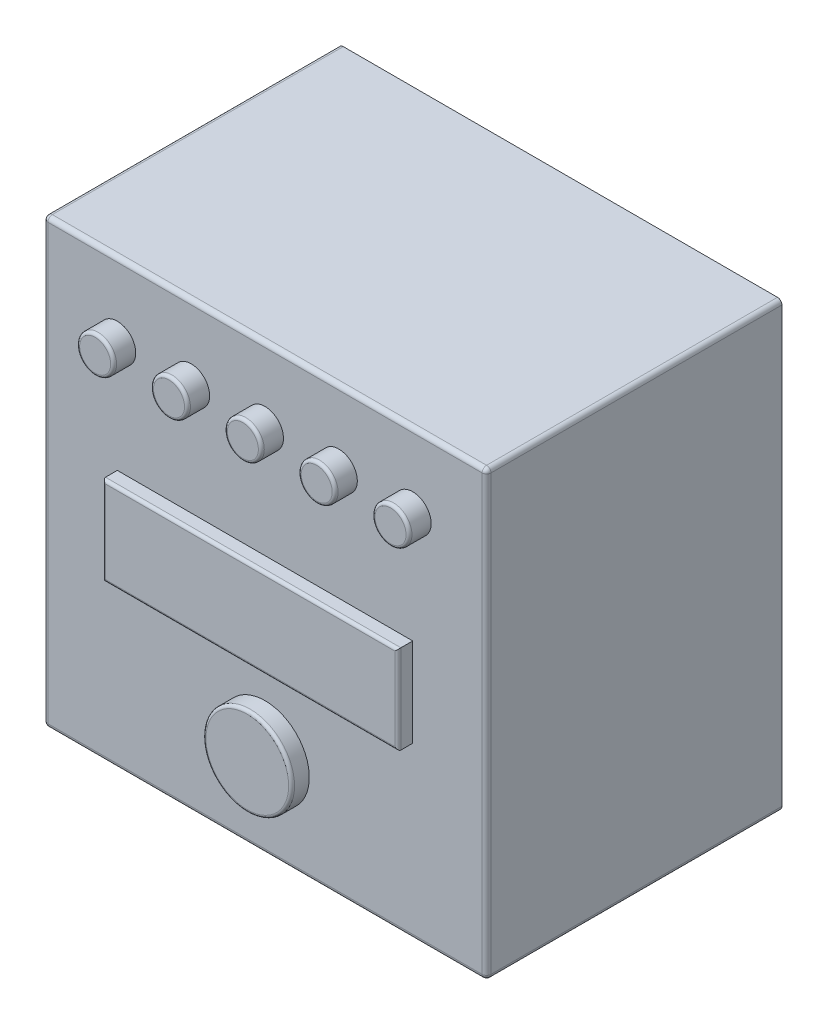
ISO-10303-21;
HEADER;
FILE_DESCRIPTION(('STEP AP214'),'2;1');
FILE_NAME('part.step','',(''),(''),'','','');
FILE_SCHEMA(('AUTOMOTIVE_DESIGN { 1 0 10303 214 1 1 1 1 }'));
ENDSEC;
DATA;
#1=APPLICATION_CONTEXT('core data for automotive mechanical design processes');
#2=APPLICATION_PROTOCOL_DEFINITION('international standard','automotive_design',2000,#1);
#3=PRODUCT_CONTEXT('',#1,'mechanical');
#4=PRODUCT('Part','Part','',(#3));
#5=PRODUCT_RELATED_PRODUCT_CATEGORY('part','',(#4));
#6=PRODUCT_DEFINITION_FORMATION('','',#4);
#7=PRODUCT_DEFINITION_CONTEXT('part definition',#1,'design');
#8=PRODUCT_DEFINITION('design','',#6,#7);
#9=PRODUCT_DEFINITION_SHAPE('','',#8);
#10=(LENGTH_UNIT() NAMED_UNIT(*) SI_UNIT(.MILLI.,.METRE.));
#11=(NAMED_UNIT(*) PLANE_ANGLE_UNIT() SI_UNIT($,.RADIAN.));
#12=(NAMED_UNIT(*) SI_UNIT($,.STERADIAN.) SOLID_ANGLE_UNIT());
#13=UNCERTAINTY_MEASURE_WITH_UNIT(LENGTH_MEASURE(1.E-05),#10,'distance_accuracy_value','');
#14=(GEOMETRIC_REPRESENTATION_CONTEXT(3) GLOBAL_UNCERTAINTY_ASSIGNED_CONTEXT((#13)) GLOBAL_UNIT_ASSIGNED_CONTEXT((#10,
#11,#12)) REPRESENTATION_CONTEXT('',''));
#15=CARTESIAN_POINT('',(0.,0.,0.));
#16=DIRECTION('',(0.,0.,1.));
#17=DIRECTION('',(1.,0.,0.));
#18=AXIS2_PLACEMENT_3D('',#15,#16,#17);
#19=CARTESIAN_POINT('',(0.,300.,200.));
#20=DIRECTION('',(0.,0.,-1.));
#21=DIRECTION('',(-1.,0.,0.));
#22=AXIS2_PLACEMENT_3D('',#19,#20,#21);
#23=PLANE('',#22);
#24=DIRECTION('',(0.,-1.,0.));
#25=VECTOR('',#24,1.);
#26=CARTESIAN_POINT('',(3.,300.,200.));
#27=LINE('',#26,#25);
#28=CARTESIAN_POINT('',(3.,297.,200.));
#29=VERTEX_POINT('',#28);
#30=CARTESIAN_POINT('',(3.,3.,200.));
#31=VERTEX_POINT('',#30);
#32=EDGE_CURVE('E333',#29,#31,#27,.T.);
#33=ORIENTED_EDGE('',*,*,#32,.T.);
#34=DIRECTION('',(1.,0.,0.));
#35=VECTOR('',#34,1.);
#36=CARTESIAN_POINT('',(0.,3.,200.));
#37=LINE('',#36,#35);
#38=CARTESIAN_POINT('',(297.,3.,200.));
#39=VERTEX_POINT('',#38);
#40=EDGE_CURVE('E339',#31,#39,#37,.T.);
#41=ORIENTED_EDGE('',*,*,#40,.T.);
#42=DIRECTION('',(0.,1.,0.));
#43=VECTOR('',#42,1.);
#44=CARTESIAN_POINT('',(297.,300.,200.));
#45=LINE('',#44,#43);
#46=CARTESIAN_POINT('',(297.,297.,200.));
#47=VERTEX_POINT('',#46);
#48=EDGE_CURVE('E337',#39,#47,#45,.T.);
#49=ORIENTED_EDGE('',*,*,#48,.T.);
#50=DIRECTION('',(-1.,0.,0.));
#51=VECTOR('',#50,1.);
#52=CARTESIAN_POINT('',(0.,297.,200.));
#53=LINE('',#52,#51);
#54=EDGE_CURVE('E335',#47,#29,#53,.T.);
#55=ORIENTED_EDGE('',*,*,#54,.T.);
#56=EDGE_LOOP('',(#33,#41,#49,#55));
#57=FACE_BOUND('',#56,.T.);
#58=DIRECTION('',(0.,-1.,0.));
#59=VECTOR('',#58,1.);
#60=CARTESIAN_POINT('',(50.,175.,200.));
#61=LINE('',#60,#59);
#62=CARTESIAN_POINT('',(50.,175.,200.));
#63=VERTEX_POINT('',#62);
#64=CARTESIAN_POINT('',(50.,115.,200.));
#65=VERTEX_POINT('',#64);
#66=EDGE_CURVE('E169',#63,#65,#61,.T.);
#67=ORIENTED_EDGE('',*,*,#66,.F.);
#68=DIRECTION('',(-1.,0.,0.));
#69=VECTOR('',#68,1.);
#70=CARTESIAN_POINT('',(50.,175.,200.));
#71=LINE('',#70,#69);
#72=CARTESIAN_POINT('',(250.,175.,200.));
#73=VERTEX_POINT('',#72);
#74=EDGE_CURVE('E176',#73,#63,#71,.T.);
#75=ORIENTED_EDGE('',*,*,#74,.F.);
#76=DIRECTION('',(0.,1.,0.));
#77=VECTOR('',#76,1.);
#78=CARTESIAN_POINT('',(250.,175.,200.));
#79=LINE('',#78,#77);
#80=CARTESIAN_POINT('',(250.,115.,200.));
#81=VERTEX_POINT('',#80);
#82=EDGE_CURVE('E190',#81,#73,#79,.T.);
#83=ORIENTED_EDGE('',*,*,#82,.F.);
#84=DIRECTION('',(1.,0.,0.));
#85=VECTOR('',#84,1.);
#86=CARTESIAN_POINT('',(50.,115.,200.));
#87=LINE('',#86,#85);
#88=EDGE_CURVE('E185',#65,#81,#87,.T.);
#89=ORIENTED_EDGE('',*,*,#88,.F.);
#90=EDGE_LOOP('',(#67,#75,#83,#89));
#91=FACE_BOUND('',#90,.T.);
#92=CARTESIAN_POINT('',(200.,250.,200.));
#93=DIRECTION('',(0.,0.,-1.));
#94=DIRECTION('',(-1.,0.,0.));
#95=AXIS2_PLACEMENT_3D('',#92,#93,#94);
#96=CIRCLE('',#95,12.5);
#97=CARTESIAN_POINT('',(187.5,250.,200.));
#98=VERTEX_POINT('',#97);
#99=EDGE_CURVE('E250',#98,#98,#96,.F.);
#100=ORIENTED_EDGE('',*,*,#99,.F.);
#101=EDGE_LOOP('',(#100));
#102=FACE_BOUND('',#101,.T.);
#103=CARTESIAN_POINT('',(100.,250.,200.));
#104=DIRECTION('',(0.,0.,-1.));
#105=DIRECTION('',(-1.,0.,0.));
#106=AXIS2_PLACEMENT_3D('',#103,#104,#105);
#107=CIRCLE('',#106,12.5);
#108=CARTESIAN_POINT('',(87.5,250.,200.));
#109=VERTEX_POINT('',#108);
#110=EDGE_CURVE('E244',#109,#109,#107,.F.);
#111=ORIENTED_EDGE('',*,*,#110,.F.);
#112=EDGE_LOOP('',(#111));
#113=FACE_BOUND('',#112,.T.);
#114=CARTESIAN_POINT('',(50.,250.,200.));
#115=DIRECTION('',(0.,0.,-1.));
#116=DIRECTION('',(-1.,0.,0.));
#117=AXIS2_PLACEMENT_3D('',#114,#115,#116);
#118=CIRCLE('',#117,12.5);
#119=CARTESIAN_POINT('',(37.5,250.,200.));
#120=VERTEX_POINT('',#119);
#121=EDGE_CURVE('E214',#120,#120,#118,.F.);
#122=ORIENTED_EDGE('',*,*,#121,.F.);
#123=EDGE_LOOP('',(#122));
#124=FACE_BOUND('',#123,.T.);
#125=CARTESIAN_POINT('',(150.,250.,200.));
#126=DIRECTION('',(0.,0.,-1.));
#127=DIRECTION('',(-1.,0.,0.));
#128=AXIS2_PLACEMENT_3D('',#125,#126,#127);
#129=CIRCLE('',#128,12.5);
#130=CARTESIAN_POINT('',(137.5,250.,200.));
#131=VERTEX_POINT('',#130);
#132=EDGE_CURVE('E247',#131,#131,#129,.F.);
#133=ORIENTED_EDGE('',*,*,#132,.F.);
#134=EDGE_LOOP('',(#133));
#135=FACE_BOUND('',#134,.T.);
#136=CARTESIAN_POINT('',(250.,250.,200.));
#137=DIRECTION('',(0.,0.,-1.));
#138=DIRECTION('',(-1.,0.,0.));
#139=AXIS2_PLACEMENT_3D('',#136,#137,#138);
#140=CIRCLE('',#139,12.5);
#141=CARTESIAN_POINT('',(237.5,250.,200.));
#142=VERTEX_POINT('',#141);
#143=EDGE_CURVE('E253',#142,#142,#140,.F.);
#144=ORIENTED_EDGE('',*,*,#143,.F.);
#145=EDGE_LOOP('',(#144));
#146=FACE_BOUND('',#145,.T.);
#147=CARTESIAN_POINT('',(150.,60.,200.));
#148=DIRECTION('',(0.,0.,-1.));
#149=DIRECTION('',(-1.,0.,0.));
#150=AXIS2_PLACEMENT_3D('',#147,#148,#149);
#151=CIRCLE('',#150,30.);
#152=CARTESIAN_POINT('',(120.,60.,200.));
#153=VERTEX_POINT('',#152);
#154=EDGE_CURVE('E303',#153,#153,#151,.F.);
#155=ORIENTED_EDGE('',*,*,#154,.F.);
#156=EDGE_LOOP('',(#155));
#157=FACE_BOUND('',#156,.T.);
#158=ADVANCED_FACE('F28',(#57,#91,#102,#113,#124,#135,#146,#157),#23,.F.);
#159=CARTESIAN_POINT('',(0.,0.,200.));
#160=DIRECTION('',(1.,0.,0.));
#161=DIRECTION('',(0.,0.,-1.));
#162=AXIS2_PLACEMENT_3D('',#159,#160,#161);
#163=PLANE('',#162);
#164=DIRECTION('',(0.,-1.,0.));
#165=VECTOR('',#164,1.);
#166=CARTESIAN_POINT('',(0.,0.,0.));
#167=LINE('',#166,#165);
#168=CARTESIAN_POINT('',(0.,297.,0.));
#169=VERTEX_POINT('',#168);
#170=CARTESIAN_POINT('',(0.,3.,0.));
#171=VERTEX_POINT('',#170);
#172=EDGE_CURVE('E200',#169,#171,#167,.T.);
#173=ORIENTED_EDGE('',*,*,#172,.T.);
#174=DIRECTION('',(0.,0.,-1.));
#175=VECTOR('',#174,1.);
#176=CARTESIAN_POINT('',(0.,3.,200.));
#177=LINE('',#176,#175);
#178=CARTESIAN_POINT('',(0.,3.,197.));
#179=VERTEX_POINT('',#178);
#180=EDGE_CURVE('E325',#171,#179,#177,.F.);
#181=ORIENTED_EDGE('',*,*,#180,.T.);
#182=DIRECTION('',(0.,-1.,0.));
#183=VECTOR('',#182,1.);
#184=CARTESIAN_POINT('',(0.,0.,197.));
#185=LINE('',#184,#183);
#186=CARTESIAN_POINT('',(0.,297.,197.));
#187=VERTEX_POINT('',#186);
#188=EDGE_CURVE('E321',#179,#187,#185,.F.);
#189=ORIENTED_EDGE('',*,*,#188,.T.);
#190=DIRECTION('',(0.,0.,-1.));
#191=VECTOR('',#190,1.);
#192=CARTESIAN_POINT('',(0.,297.,200.));
#193=LINE('',#192,#191);
#194=EDGE_CURVE('E323',#187,#169,#193,.T.);
#195=ORIENTED_EDGE('',*,*,#194,.T.);
#196=EDGE_LOOP('',(#173,#181,#189,#195));
#197=FACE_BOUND('',#196,.T.);
#198=ADVANCED_FACE('F364',(#197),#163,.F.);
#199=CARTESIAN_POINT('',(0.,0.,200.));
#200=DIRECTION('',(0.,1.,0.));
#201=DIRECTION('',(0.,0.,1.));
#202=AXIS2_PLACEMENT_3D('',#199,#200,#201);
#203=PLANE('',#202);
#204=DIRECTION('',(1.,0.,0.));
#205=VECTOR('',#204,1.);
#206=CARTESIAN_POINT('',(0.,0.,197.));
#207=LINE('',#206,#205);
#208=CARTESIAN_POINT('',(297.,0.,197.));
#209=VERTEX_POINT('',#208);
#210=CARTESIAN_POINT('',(3.,0.,197.));
#211=VERTEX_POINT('',#210);
#212=EDGE_CURVE('E306',#209,#211,#207,.F.);
#213=ORIENTED_EDGE('',*,*,#212,.T.);
#214=DIRECTION('',(0.,0.,-1.));
#215=VECTOR('',#214,1.);
#216=CARTESIAN_POINT('',(3.,0.,200.));
#217=LINE('',#216,#215);
#218=CARTESIAN_POINT('',(3.,0.,0.));
#219=VERTEX_POINT('',#218);
#220=EDGE_CURVE('E310',#211,#219,#217,.T.);
#221=ORIENTED_EDGE('',*,*,#220,.T.);
#222=DIRECTION('',(1.,0.,0.));
#223=VECTOR('',#222,1.);
#224=CARTESIAN_POINT('',(0.,0.,0.));
#225=LINE('',#224,#223);
#226=CARTESIAN_POINT('',(297.,0.,0.));
#227=VERTEX_POINT('',#226);
#228=EDGE_CURVE('E203',#219,#227,#225,.T.);
#229=ORIENTED_EDGE('',*,*,#228,.T.);
#230=DIRECTION('',(0.,0.,-1.));
#231=VECTOR('',#230,1.);
#232=CARTESIAN_POINT('',(297.,0.,200.));
#233=LINE('',#232,#231);
#234=EDGE_CURVE('E308',#227,#209,#233,.F.);
#235=ORIENTED_EDGE('',*,*,#234,.T.);
#236=EDGE_LOOP('',(#213,#221,#229,#235));
#237=FACE_BOUND('',#236,.T.);
#238=ADVANCED_FACE('F371',(#237),#203,.F.);
#239=CARTESIAN_POINT('',(300.,0.,200.));
#240=DIRECTION('',(-1.,0.,0.));
#241=DIRECTION('',(0.,0.,1.));
#242=AXIS2_PLACEMENT_3D('',#239,#240,#241);
#243=PLANE('',#242);
#244=DIRECTION('',(0.,1.,0.));
#245=VECTOR('',#244,1.);
#246=CARTESIAN_POINT('',(300.,0.,197.));
#247=LINE('',#246,#245);
#248=CARTESIAN_POINT('',(300.,297.,197.));
#249=VERTEX_POINT('',#248);
#250=CARTESIAN_POINT('',(300.,3.,197.));
#251=VERTEX_POINT('',#250);
#252=EDGE_CURVE('E329',#249,#251,#247,.F.);
#253=ORIENTED_EDGE('',*,*,#252,.T.);
#254=DIRECTION('',(0.,0.,-1.));
#255=VECTOR('',#254,1.);
#256=CARTESIAN_POINT('',(300.,3.,200.));
#257=LINE('',#256,#255);
#258=CARTESIAN_POINT('',(300.,3.,0.));
#259=VERTEX_POINT('',#258);
#260=EDGE_CURVE('E331',#251,#259,#257,.T.);
#261=ORIENTED_EDGE('',*,*,#260,.T.);
#262=DIRECTION('',(0.,1.,0.));
#263=VECTOR('',#262,1.);
#264=CARTESIAN_POINT('',(300.,0.,0.));
#265=LINE('',#264,#263);
#266=CARTESIAN_POINT('',(300.,297.,0.));
#267=VERTEX_POINT('',#266);
#268=EDGE_CURVE('E206',#259,#267,#265,.T.);
#269=ORIENTED_EDGE('',*,*,#268,.T.);
#270=DIRECTION('',(0.,0.,-1.));
#271=VECTOR('',#270,1.);
#272=CARTESIAN_POINT('',(300.,297.,200.));
#273=LINE('',#272,#271);
#274=EDGE_CURVE('E327',#267,#249,#273,.F.);
#275=ORIENTED_EDGE('',*,*,#274,.T.);
#276=EDGE_LOOP('',(#253,#261,#269,#275));
#277=FACE_BOUND('',#276,.T.);
#278=ADVANCED_FACE('F381',(#277),#243,.F.);
#279=CARTESIAN_POINT('',(0.,300.,200.));
#280=DIRECTION('',(0.,-1.,0.));
#281=DIRECTION('',(0.,0.,-1.));
#282=AXIS2_PLACEMENT_3D('',#279,#280,#281);
#283=PLANE('',#282);
#284=DIRECTION('',(-1.,0.,0.));
#285=VECTOR('',#284,1.);
#286=CARTESIAN_POINT('',(0.,300.,197.));
#287=LINE('',#286,#285);
#288=CARTESIAN_POINT('',(3.,300.,197.));
#289=VERTEX_POINT('',#288);
#290=CARTESIAN_POINT('',(297.,300.,197.));
#291=VERTEX_POINT('',#290);
#292=EDGE_CURVE('E44',#289,#291,#287,.F.);
#293=ORIENTED_EDGE('',*,*,#292,.T.);
#294=DIRECTION('',(0.,0.,-1.));
#295=VECTOR('',#294,1.);
#296=CARTESIAN_POINT('',(297.,300.,200.));
#297=LINE('',#296,#295);
#298=CARTESIAN_POINT('',(297.,300.,0.));
#299=VERTEX_POINT('',#298);
#300=EDGE_CURVE('E344',#291,#299,#297,.T.);
#301=ORIENTED_EDGE('',*,*,#300,.T.);
#302=DIRECTION('',(-1.,0.,0.));
#303=VECTOR('',#302,1.);
#304=CARTESIAN_POINT('',(0.,300.,0.));
#305=LINE('',#304,#303);
#306=CARTESIAN_POINT('',(3.,300.,0.));
#307=VERTEX_POINT('',#306);
#308=EDGE_CURVE('E209',#299,#307,#305,.T.);
#309=ORIENTED_EDGE('',*,*,#308,.T.);
#310=DIRECTION('',(0.,0.,-1.));
#311=VECTOR('',#310,1.);
#312=CARTESIAN_POINT('',(3.,300.,200.));
#313=LINE('',#312,#311);
#314=EDGE_CURVE('E49',#307,#289,#313,.F.);
#315=ORIENTED_EDGE('',*,*,#314,.T.);
#316=EDGE_LOOP('',(#293,#301,#309,#315));
#317=FACE_BOUND('',#316,.T.);
#318=ADVANCED_FACE('F378',(#317),#283,.F.);
#319=CARTESIAN_POINT('',(0.,300.,0.));
#320=DIRECTION('',(0.,0.,-1.));
#321=DIRECTION('',(-1.,0.,0.));
#322=AXIS2_PLACEMENT_3D('',#319,#320,#321);
#323=PLANE('',#322);
#324=ORIENTED_EDGE('',*,*,#228,.F.);
#325=CARTESIAN_POINT('',(3.,3.,0.));
#326=DIRECTION('',(0.,0.,-1.));
#327=DIRECTION('',(-1.,0.,0.));
#328=AXIS2_PLACEMENT_3D('',#325,#326,#327);
#329=CIRCLE('',#328,3.);
#330=EDGE_CURVE('E319',#219,#171,#329,.T.);
#331=ORIENTED_EDGE('',*,*,#330,.T.);
#332=ORIENTED_EDGE('',*,*,#172,.F.);
#333=CARTESIAN_POINT('',(3.,297.,0.));
#334=DIRECTION('',(0.,0.,-1.));
#335=DIRECTION('',(-1.,0.,0.));
#336=AXIS2_PLACEMENT_3D('',#333,#334,#335);
#337=CIRCLE('',#336,3.);
#338=EDGE_CURVE('E313',#169,#307,#337,.T.);
#339=ORIENTED_EDGE('',*,*,#338,.T.);
#340=ORIENTED_EDGE('',*,*,#308,.F.);
#341=CARTESIAN_POINT('',(297.,297.,0.));
#342=DIRECTION('',(0.,0.,-1.));
#343=DIRECTION('',(-1.,0.,0.));
#344=AXIS2_PLACEMENT_3D('',#341,#342,#343);
#345=CIRCLE('',#344,3.);
#346=EDGE_CURVE('E315',#299,#267,#345,.T.);
#347=ORIENTED_EDGE('',*,*,#346,.T.);
#348=ORIENTED_EDGE('',*,*,#268,.F.);
#349=CARTESIAN_POINT('',(297.,3.,0.));
#350=DIRECTION('',(0.,0.,-1.));
#351=DIRECTION('',(-1.,0.,0.));
#352=AXIS2_PLACEMENT_3D('',#349,#350,#351);
#353=CIRCLE('',#352,3.);
#354=EDGE_CURVE('E317',#259,#227,#353,.T.);
#355=ORIENTED_EDGE('',*,*,#354,.T.);
#356=EDGE_LOOP('',(#324,#331,#332,#339,#340,#347,#348,#355));
#357=FACE_BOUND('',#356,.T.);
#358=ADVANCED_FACE('F376',(#357),#323,.T.);
#359=CARTESIAN_POINT('',(50.,250.,215.));
#360=DIRECTION('',(0.,0.,-1.));
#361=DIRECTION('',(-1.,0.,0.));
#362=AXIS2_PLACEMENT_3D('',#359,#360,#361);
#363=CYLINDRICAL_SURFACE('',#362,12.5);
#364=CARTESIAN_POINT('',(50.,250.,213.));
#365=DIRECTION('',(0.,0.,1.));
#366=DIRECTION('',(1.,0.,0.));
#367=AXIS2_PLACEMENT_3D('',#364,#365,#366);
#368=CIRCLE('',#367,12.5);
#369=CARTESIAN_POINT('',(62.5,250.,213.));
#370=VERTEX_POINT('',#369);
#371=EDGE_CURVE('E283',#370,#370,#368,.F.);
#372=ORIENTED_EDGE('',*,*,#371,.T.);
#373=EDGE_LOOP('',(#372));
#374=FACE_BOUND('',#373,.T.);
#375=ORIENTED_EDGE('',*,*,#121,.T.);
#376=EDGE_LOOP('',(#375));
#377=FACE_BOUND('',#376,.T.);
#378=ADVANCED_FACE('F427',(#374,#377),#363,.T.);
#379=CARTESIAN_POINT('',(50.,250.,215.));
#380=DIRECTION('',(0.,0.,1.));
#381=DIRECTION('',(1.,0.,0.));
#382=AXIS2_PLACEMENT_3D('',#379,#380,#381);
#383=PLANE('',#382);
#384=CARTESIAN_POINT('',(50.,250.,215.));
#385=DIRECTION('',(0.,0.,1.));
#386=DIRECTION('',(1.,0.,0.));
#387=AXIS2_PLACEMENT_3D('',#384,#385,#386);
#388=CIRCLE('',#387,10.5);
#389=CARTESIAN_POINT('',(60.5,250.,215.));
#390=VERTEX_POINT('',#389);
#391=EDGE_CURVE('E280',#390,#390,#388,.T.);
#392=ORIENTED_EDGE('',*,*,#391,.T.);
#393=EDGE_LOOP('',(#392));
#394=FACE_BOUND('',#393,.T.);
#395=ADVANCED_FACE('F430',(#394),#383,.T.);
#396=CARTESIAN_POINT('',(100.,250.,215.));
#397=DIRECTION('',(0.,0.,-1.));
#398=DIRECTION('',(-1.,0.,0.));
#399=AXIS2_PLACEMENT_3D('',#396,#397,#398);
#400=CYLINDRICAL_SURFACE('',#399,12.5);
#401=CARTESIAN_POINT('',(100.,250.,213.));
#402=DIRECTION('',(0.,0.,1.));
#403=DIRECTION('',(1.,0.,0.));
#404=AXIS2_PLACEMENT_3D('',#401,#402,#403);
#405=CIRCLE('',#404,12.5);
#406=CARTESIAN_POINT('',(112.5,250.,213.));
#407=VERTEX_POINT('',#406);
#408=EDGE_CURVE('E265',#407,#407,#405,.F.);
#409=ORIENTED_EDGE('',*,*,#408,.T.);
#410=EDGE_LOOP('',(#409));
#411=FACE_BOUND('',#410,.T.);
#412=ORIENTED_EDGE('',*,*,#110,.T.);
#413=EDGE_LOOP('',(#412));
#414=FACE_BOUND('',#413,.T.);
#415=ADVANCED_FACE('F437',(#411,#414),#400,.T.);
#416=CARTESIAN_POINT('',(100.,250.,215.));
#417=DIRECTION('',(0.,0.,1.));
#418=DIRECTION('',(1.,0.,0.));
#419=AXIS2_PLACEMENT_3D('',#416,#417,#418);
#420=PLANE('',#419);
#421=CARTESIAN_POINT('',(100.,250.,215.));
#422=DIRECTION('',(0.,0.,1.));
#423=DIRECTION('',(1.,0.,0.));
#424=AXIS2_PLACEMENT_3D('',#421,#422,#423);
#425=CIRCLE('',#424,10.5);
#426=CARTESIAN_POINT('',(110.5,250.,215.));
#427=VERTEX_POINT('',#426);
#428=EDGE_CURVE('E262',#427,#427,#425,.T.);
#429=ORIENTED_EDGE('',*,*,#428,.T.);
#430=EDGE_LOOP('',(#429));
#431=FACE_BOUND('',#430,.T.);
#432=ADVANCED_FACE('F445',(#431),#420,.T.);
#433=CARTESIAN_POINT('',(150.,250.,215.));
#434=DIRECTION('',(0.,0.,-1.));
#435=DIRECTION('',(-1.,0.,0.));
#436=AXIS2_PLACEMENT_3D('',#433,#434,#435);
#437=CYLINDRICAL_SURFACE('',#436,12.5);
#438=CARTESIAN_POINT('',(150.,250.,213.));
#439=DIRECTION('',(0.,0.,1.));
#440=DIRECTION('',(1.,0.,0.));
#441=AXIS2_PLACEMENT_3D('',#438,#439,#440);
#442=CIRCLE('',#441,12.5);
#443=CARTESIAN_POINT('',(162.5,250.,213.));
#444=VERTEX_POINT('',#443);
#445=EDGE_CURVE('E277',#444,#444,#442,.F.);
#446=ORIENTED_EDGE('',*,*,#445,.T.);
#447=EDGE_LOOP('',(#446));
#448=FACE_BOUND('',#447,.T.);
#449=ORIENTED_EDGE('',*,*,#132,.T.);
#450=EDGE_LOOP('',(#449));
#451=FACE_BOUND('',#450,.T.);
#452=ADVANCED_FACE('F453',(#448,#451),#437,.T.);
#453=CARTESIAN_POINT('',(150.,250.,215.));
#454=DIRECTION('',(0.,0.,1.));
#455=DIRECTION('',(1.,0.,0.));
#456=AXIS2_PLACEMENT_3D('',#453,#454,#455);
#457=PLANE('',#456);
#458=CARTESIAN_POINT('',(150.,250.,215.));
#459=DIRECTION('',(0.,0.,1.));
#460=DIRECTION('',(1.,0.,0.));
#461=AXIS2_PLACEMENT_3D('',#458,#459,#460);
#462=CIRCLE('',#461,10.5);
#463=CARTESIAN_POINT('',(160.5,250.,215.));
#464=VERTEX_POINT('',#463);
#465=EDGE_CURVE('E274',#464,#464,#462,.T.);
#466=ORIENTED_EDGE('',*,*,#465,.T.);
#467=EDGE_LOOP('',(#466));
#468=FACE_BOUND('',#467,.T.);
#469=ADVANCED_FACE('F461',(#468),#457,.T.);
#470=CARTESIAN_POINT('',(200.,250.,215.));
#471=DIRECTION('',(0.,0.,-1.));
#472=DIRECTION('',(-1.,0.,0.));
#473=AXIS2_PLACEMENT_3D('',#470,#471,#472);
#474=CYLINDRICAL_SURFACE('',#473,12.5);
#475=CARTESIAN_POINT('',(200.,250.,213.));
#476=DIRECTION('',(0.,0.,1.));
#477=DIRECTION('',(1.,0.,0.));
#478=AXIS2_PLACEMENT_3D('',#475,#476,#477);
#479=CIRCLE('',#478,12.5);
#480=CARTESIAN_POINT('',(212.5,250.,213.));
#481=VERTEX_POINT('',#480);
#482=EDGE_CURVE('E259',#481,#481,#479,.F.);
#483=ORIENTED_EDGE('',*,*,#482,.T.);
#484=EDGE_LOOP('',(#483));
#485=FACE_BOUND('',#484,.T.);
#486=ORIENTED_EDGE('',*,*,#99,.T.);
#487=EDGE_LOOP('',(#486));
#488=FACE_BOUND('',#487,.T.);
#489=ADVANCED_FACE('F469',(#485,#488),#474,.T.);
#490=CARTESIAN_POINT('',(200.,250.,215.));
#491=DIRECTION('',(0.,0.,1.));
#492=DIRECTION('',(1.,0.,0.));
#493=AXIS2_PLACEMENT_3D('',#490,#491,#492);
#494=PLANE('',#493);
#495=CARTESIAN_POINT('',(200.,250.,215.));
#496=DIRECTION('',(0.,0.,1.));
#497=DIRECTION('',(1.,0.,0.));
#498=AXIS2_PLACEMENT_3D('',#495,#496,#497);
#499=CIRCLE('',#498,10.5);
#500=CARTESIAN_POINT('',(210.5,250.,215.));
#501=VERTEX_POINT('',#500);
#502=EDGE_CURVE('E256',#501,#501,#499,.T.);
#503=ORIENTED_EDGE('',*,*,#502,.T.);
#504=EDGE_LOOP('',(#503));
#505=FACE_BOUND('',#504,.T.);
#506=ADVANCED_FACE('F477',(#505),#494,.T.);
#507=CARTESIAN_POINT('',(250.,250.,215.));
#508=DIRECTION('',(0.,0.,-1.));
#509=DIRECTION('',(-1.,0.,0.));
#510=AXIS2_PLACEMENT_3D('',#507,#508,#509);
#511=CYLINDRICAL_SURFACE('',#510,12.5);
#512=CARTESIAN_POINT('',(250.,250.,213.));
#513=DIRECTION('',(0.,0.,1.));
#514=DIRECTION('',(1.,0.,0.));
#515=AXIS2_PLACEMENT_3D('',#512,#513,#514);
#516=CIRCLE('',#515,12.5);
#517=CARTESIAN_POINT('',(262.5,250.,213.));
#518=VERTEX_POINT('',#517);
#519=EDGE_CURVE('E271',#518,#518,#516,.F.);
#520=ORIENTED_EDGE('',*,*,#519,.T.);
#521=EDGE_LOOP('',(#520));
#522=FACE_BOUND('',#521,.T.);
#523=ORIENTED_EDGE('',*,*,#143,.T.);
#524=EDGE_LOOP('',(#523));
#525=FACE_BOUND('',#524,.T.);
#526=ADVANCED_FACE('F485',(#522,#525),#511,.T.);
#527=CARTESIAN_POINT('',(250.,250.,215.));
#528=DIRECTION('',(0.,0.,1.));
#529=DIRECTION('',(1.,0.,0.));
#530=AXIS2_PLACEMENT_3D('',#527,#528,#529);
#531=PLANE('',#530);
#532=CARTESIAN_POINT('',(250.,250.,215.));
#533=DIRECTION('',(0.,0.,1.));
#534=DIRECTION('',(1.,0.,0.));
#535=AXIS2_PLACEMENT_3D('',#532,#533,#534);
#536=CIRCLE('',#535,10.5);
#537=CARTESIAN_POINT('',(260.5,250.,215.));
#538=VERTEX_POINT('',#537);
#539=EDGE_CURVE('E268',#538,#538,#536,.T.);
#540=ORIENTED_EDGE('',*,*,#539,.T.);
#541=EDGE_LOOP('',(#540));
#542=FACE_BOUND('',#541,.T.);
#543=ADVANCED_FACE('F493',(#542),#531,.T.);
#544=CARTESIAN_POINT('',(200.,250.,213.));
#545=DIRECTION('',(0.,0.,1.));
#546=DIRECTION('',(1.,0.,0.));
#547=AXIS2_PLACEMENT_3D('',#544,#545,#546);
#548=TOROIDAL_SURFACE('',#547,10.5,2.);
#549=ORIENTED_EDGE('',*,*,#482,.F.);
#550=EDGE_LOOP('',(#549));
#551=FACE_BOUND('',#550,.T.);
#552=ORIENTED_EDGE('',*,*,#502,.F.);
#553=EDGE_LOOP('',(#552));
#554=FACE_BOUND('',#553,.T.);
#555=ADVANCED_FACE('F501',(#551,#554),#548,.T.);
#556=CARTESIAN_POINT('',(100.,250.,213.));
#557=DIRECTION('',(0.,0.,1.));
#558=DIRECTION('',(1.,0.,0.));
#559=AXIS2_PLACEMENT_3D('',#556,#557,#558);
#560=TOROIDAL_SURFACE('',#559,10.5,2.);
#561=ORIENTED_EDGE('',*,*,#408,.F.);
#562=EDGE_LOOP('',(#561));
#563=FACE_BOUND('',#562,.T.);
#564=ORIENTED_EDGE('',*,*,#428,.F.);
#565=EDGE_LOOP('',(#564));
#566=FACE_BOUND('',#565,.T.);
#567=ADVANCED_FACE('F509',(#563,#566),#560,.T.);
#568=CARTESIAN_POINT('',(250.,250.,213.));
#569=DIRECTION('',(0.,0.,1.));
#570=DIRECTION('',(1.,0.,0.));
#571=AXIS2_PLACEMENT_3D('',#568,#569,#570);
#572=TOROIDAL_SURFACE('',#571,10.5,2.);
#573=ORIENTED_EDGE('',*,*,#519,.F.);
#574=EDGE_LOOP('',(#573));
#575=FACE_BOUND('',#574,.T.);
#576=ORIENTED_EDGE('',*,*,#539,.F.);
#577=EDGE_LOOP('',(#576));
#578=FACE_BOUND('',#577,.T.);
#579=ADVANCED_FACE('F517',(#575,#578),#572,.T.);
#580=CARTESIAN_POINT('',(150.,250.,213.));
#581=DIRECTION('',(0.,0.,1.));
#582=DIRECTION('',(1.,0.,0.));
#583=AXIS2_PLACEMENT_3D('',#580,#581,#582);
#584=TOROIDAL_SURFACE('',#583,10.5,2.);
#585=ORIENTED_EDGE('',*,*,#445,.F.);
#586=EDGE_LOOP('',(#585));
#587=FACE_BOUND('',#586,.T.);
#588=ORIENTED_EDGE('',*,*,#465,.F.);
#589=EDGE_LOOP('',(#588));
#590=FACE_BOUND('',#589,.T.);
#591=ADVANCED_FACE('F525',(#587,#590),#584,.T.);
#592=CARTESIAN_POINT('',(50.,250.,213.));
#593=DIRECTION('',(0.,0.,1.));
#594=DIRECTION('',(1.,0.,0.));
#595=AXIS2_PLACEMENT_3D('',#592,#593,#594);
#596=TOROIDAL_SURFACE('',#595,10.5,2.);
#597=ORIENTED_EDGE('',*,*,#371,.F.);
#598=EDGE_LOOP('',(#597));
#599=FACE_BOUND('',#598,.T.);
#600=ORIENTED_EDGE('',*,*,#391,.F.);
#601=EDGE_LOOP('',(#600));
#602=FACE_BOUND('',#601,.T.);
#603=ADVANCED_FACE('F533',(#599,#602),#596,.T.);
#604=CARTESIAN_POINT('',(50.,175.,210.));
#605=DIRECTION('',(1.,0.,0.));
#606=DIRECTION('',(0.,1.,0.));
#607=AXIS2_PLACEMENT_3D('',#604,#605,#606);
#608=PLANE('',#607);
#609=DIRECTION('',(0.,0.,-1.));
#610=VECTOR('',#609,1.);
#611=CARTESIAN_POINT('',(50.,115.,210.));
#612=LINE('',#611,#610);
#613=CARTESIAN_POINT('',(50.,115.,208.));
#614=VERTEX_POINT('',#613);
#615=EDGE_CURVE('E198',#614,#65,#612,.T.);
#616=ORIENTED_EDGE('',*,*,#615,.F.);
#617=DIRECTION('',(0.,-1.,0.));
#618=VECTOR('',#617,1.);
#619=CARTESIAN_POINT('',(50.,175.,208.));
#620=LINE('',#619,#618);
#621=CARTESIAN_POINT('',(50.,175.,208.));
#622=VERTEX_POINT('',#621);
#623=EDGE_CURVE('E171',#614,#622,#620,.F.);
#624=ORIENTED_EDGE('',*,*,#623,.T.);
#625=DIRECTION('',(0.,0.,-1.));
#626=VECTOR('',#625,1.);
#627=CARTESIAN_POINT('',(50.,175.,210.));
#628=LINE('',#627,#626);
#629=EDGE_CURVE('E165',#622,#63,#628,.T.);
#630=ORIENTED_EDGE('',*,*,#629,.T.);
#631=ORIENTED_EDGE('',*,*,#66,.T.);
#632=EDGE_LOOP('',(#616,#624,#630,#631));
#633=FACE_BOUND('',#632,.T.);
#634=ADVANCED_FACE('F168',(#633),#608,.F.);
#635=CARTESIAN_POINT('',(50.,115.,210.));
#636=DIRECTION('',(0.,1.,0.));
#637=DIRECTION('',(0.,0.,1.));
#638=AXIS2_PLACEMENT_3D('',#635,#636,#637);
#639=PLANE('',#638);
#640=DIRECTION('',(0.,0.,-1.));
#641=VECTOR('',#640,1.);
#642=CARTESIAN_POINT('',(250.,115.,210.));
#643=LINE('',#642,#641);
#644=CARTESIAN_POINT('',(250.,115.,208.));
#645=VERTEX_POINT('',#644);
#646=EDGE_CURVE('E196',#645,#81,#643,.T.);
#647=ORIENTED_EDGE('',*,*,#646,.F.);
#648=DIRECTION('',(1.,0.,0.));
#649=VECTOR('',#648,1.);
#650=CARTESIAN_POINT('',(50.,115.,208.));
#651=LINE('',#650,#649);
#652=EDGE_CURVE('E298',#645,#614,#651,.F.);
#653=ORIENTED_EDGE('',*,*,#652,.T.);
#654=ORIENTED_EDGE('',*,*,#615,.T.);
#655=ORIENTED_EDGE('',*,*,#88,.T.);
#656=EDGE_LOOP('',(#647,#653,#654,#655));
#657=FACE_BOUND('',#656,.T.);
#658=ADVANCED_FACE('F548',(#657),#639,.F.);
#659=CARTESIAN_POINT('',(250.,175.,210.));
#660=DIRECTION('',(-1.,0.,0.));
#661=DIRECTION('',(0.,0.,1.));
#662=AXIS2_PLACEMENT_3D('',#659,#660,#661);
#663=PLANE('',#662);
#664=DIRECTION('',(0.,0.,-1.));
#665=VECTOR('',#664,1.);
#666=CARTESIAN_POINT('',(250.,175.,210.));
#667=LINE('',#666,#665);
#668=CARTESIAN_POINT('',(250.,175.,208.));
#669=VERTEX_POINT('',#668);
#670=EDGE_CURVE('E175',#669,#73,#667,.T.);
#671=ORIENTED_EDGE('',*,*,#670,.F.);
#672=DIRECTION('',(0.,1.,0.));
#673=VECTOR('',#672,1.);
#674=CARTESIAN_POINT('',(250.,115.,208.));
#675=LINE('',#674,#673);
#676=EDGE_CURVE('E295',#669,#645,#675,.F.);
#677=ORIENTED_EDGE('',*,*,#676,.T.);
#678=ORIENTED_EDGE('',*,*,#646,.T.);
#679=ORIENTED_EDGE('',*,*,#82,.T.);
#680=EDGE_LOOP('',(#671,#677,#678,#679));
#681=FACE_BOUND('',#680,.T.);
#682=ADVANCED_FACE('F555',(#681),#663,.F.);
#683=CARTESIAN_POINT('',(50.,175.,210.));
#684=DIRECTION('',(0.,-1.,0.));
#685=DIRECTION('',(0.,0.,-1.));
#686=AXIS2_PLACEMENT_3D('',#683,#684,#685);
#687=PLANE('',#686);
#688=ORIENTED_EDGE('',*,*,#629,.F.);
#689=DIRECTION('',(-1.,0.,0.));
#690=VECTOR('',#689,1.);
#691=CARTESIAN_POINT('',(250.,175.,208.));
#692=LINE('',#691,#690);
#693=EDGE_CURVE('E300',#622,#669,#692,.F.);
#694=ORIENTED_EDGE('',*,*,#693,.T.);
#695=ORIENTED_EDGE('',*,*,#670,.T.);
#696=ORIENTED_EDGE('',*,*,#74,.T.);
#697=EDGE_LOOP('',(#688,#694,#695,#696));
#698=FACE_BOUND('',#697,.T.);
#699=ADVANCED_FACE('F188',(#698),#687,.F.);
#700=CARTESIAN_POINT('',(50.,115.,210.));
#701=DIRECTION('',(0.,0.,1.));
#702=DIRECTION('',(1.,0.,0.));
#703=AXIS2_PLACEMENT_3D('',#700,#701,#702);
#704=PLANE('',#703);
#705=DIRECTION('',(1.,0.,0.));
#706=VECTOR('',#705,1.);
#707=CARTESIAN_POINT('',(250.,117.,210.));
#708=LINE('',#707,#706);
#709=CARTESIAN_POINT('',(52.,117.,210.));
#710=VERTEX_POINT('',#709);
#711=CARTESIAN_POINT('',(248.,117.,210.));
#712=VERTEX_POINT('',#711);
#713=EDGE_CURVE('E290',#710,#712,#708,.T.);
#714=ORIENTED_EDGE('',*,*,#713,.T.);
#715=DIRECTION('',(0.,1.,0.));
#716=VECTOR('',#715,1.);
#717=CARTESIAN_POINT('',(248.,175.,210.));
#718=LINE('',#717,#716);
#719=CARTESIAN_POINT('',(248.,173.,210.));
#720=VERTEX_POINT('',#719);
#721=EDGE_CURVE('E292',#712,#720,#718,.T.);
#722=ORIENTED_EDGE('',*,*,#721,.T.);
#723=DIRECTION('',(-1.,0.,0.));
#724=VECTOR('',#723,1.);
#725=CARTESIAN_POINT('',(50.,173.,210.));
#726=LINE('',#725,#724);
#727=CARTESIAN_POINT('',(52.,173.,210.));
#728=VERTEX_POINT('',#727);
#729=EDGE_CURVE('E288',#720,#728,#726,.T.);
#730=ORIENTED_EDGE('',*,*,#729,.T.);
#731=DIRECTION('',(0.,-1.,0.));
#732=VECTOR('',#731,1.);
#733=CARTESIAN_POINT('',(52.,115.,210.));
#734=LINE('',#733,#732);
#735=EDGE_CURVE('E286',#728,#710,#734,.T.);
#736=ORIENTED_EDGE('',*,*,#735,.T.);
#737=EDGE_LOOP('',(#714,#722,#730,#736));
#738=FACE_BOUND('',#737,.T.);
#739=ADVANCED_FACE('F570',(#738),#704,.T.);
#740=CARTESIAN_POINT('',(52.,115.,208.));
#741=DIRECTION('',(0.,1.,0.));
#742=DIRECTION('',(-1.,0.,0.));
#743=AXIS2_PLACEMENT_3D('',#740,#741,#742);
#744=CYLINDRICAL_SURFACE('',#743,2.);
#745=CARTESIAN_POINT('',(52.,173.,208.));
#746=DIRECTION('',(0.707106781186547,0.707106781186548,0.));
#747=DIRECTION('',(-0.707106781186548,0.707106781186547,0.));
#748=AXIS2_PLACEMENT_3D('',#745,#746,#747);
#749=ELLIPSE('',#748,2.82842712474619,2.);
#750=EDGE_CURVE('E766',#622,#728,#749,.T.);
#751=ORIENTED_EDGE('',*,*,#750,.F.);
#752=ORIENTED_EDGE('',*,*,#623,.F.);
#753=CARTESIAN_POINT('',(52.,117.,208.));
#754=DIRECTION('',(-0.707106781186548,0.707106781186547,0.));
#755=DIRECTION('',(0.707106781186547,0.707106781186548,0.));
#756=AXIS2_PLACEMENT_3D('',#753,#754,#755);
#757=ELLIPSE('',#756,2.82842712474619,2.);
#758=EDGE_CURVE('E186',#710,#614,#757,.F.);
#759=ORIENTED_EDGE('',*,*,#758,.F.);
#760=ORIENTED_EDGE('',*,*,#735,.F.);
#761=EDGE_LOOP('',(#751,#752,#759,#760));
#762=FACE_BOUND('',#761,.T.);
#763=ADVANCED_FACE('F577',(#762),#744,.T.);
#764=CARTESIAN_POINT('',(50.,117.,208.));
#765=DIRECTION('',(-1.,0.,0.));
#766=DIRECTION('',(0.,0.,1.));
#767=AXIS2_PLACEMENT_3D('',#764,#765,#766);
#768=CYLINDRICAL_SURFACE('',#767,2.);
#769=ORIENTED_EDGE('',*,*,#758,.T.);
#770=ORIENTED_EDGE('',*,*,#652,.F.);
#771=CARTESIAN_POINT('',(248.,117.,208.));
#772=DIRECTION('',(-0.707106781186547,-0.707106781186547,0.));
#773=DIRECTION('',(-0.707106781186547,0.707106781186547,0.));
#774=AXIS2_PLACEMENT_3D('',#771,#772,#773);
#775=ELLIPSE('',#774,2.82842712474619,2.);
#776=EDGE_CURVE('E764',#712,#645,#775,.F.);
#777=ORIENTED_EDGE('',*,*,#776,.F.);
#778=ORIENTED_EDGE('',*,*,#713,.F.);
#779=EDGE_LOOP('',(#769,#770,#777,#778));
#780=FACE_BOUND('',#779,.T.);
#781=ADVANCED_FACE('F585',(#780),#768,.T.);
#782=CARTESIAN_POINT('',(50.,173.,208.));
#783=DIRECTION('',(1.,0.,0.));
#784=DIRECTION('',(0.,0.,-1.));
#785=AXIS2_PLACEMENT_3D('',#782,#783,#784);
#786=CYLINDRICAL_SURFACE('',#785,2.);
#787=ORIENTED_EDGE('',*,*,#750,.T.);
#788=ORIENTED_EDGE('',*,*,#729,.F.);
#789=CARTESIAN_POINT('',(248.,173.,208.));
#790=DIRECTION('',(0.707106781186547,-0.707106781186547,0.));
#791=DIRECTION('',(0.707106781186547,0.707106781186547,0.));
#792=AXIS2_PLACEMENT_3D('',#789,#790,#791);
#793=ELLIPSE('',#792,2.82842712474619,2.);
#794=EDGE_CURVE('E762',#669,#720,#793,.T.);
#795=ORIENTED_EDGE('',*,*,#794,.F.);
#796=ORIENTED_EDGE('',*,*,#693,.F.);
#797=EDGE_LOOP('',(#787,#788,#795,#796));
#798=FACE_BOUND('',#797,.T.);
#799=ADVANCED_FACE('F593',(#798),#786,.T.);
#800=CARTESIAN_POINT('',(248.,115.,208.));
#801=DIRECTION('',(0.,-1.,0.));
#802=DIRECTION('',(0.,0.,-1.));
#803=AXIS2_PLACEMENT_3D('',#800,#801,#802);
#804=CYLINDRICAL_SURFACE('',#803,2.);
#805=ORIENTED_EDGE('',*,*,#776,.T.);
#806=ORIENTED_EDGE('',*,*,#676,.F.);
#807=ORIENTED_EDGE('',*,*,#794,.T.);
#808=ORIENTED_EDGE('',*,*,#721,.F.);
#809=EDGE_LOOP('',(#805,#806,#807,#808));
#810=FACE_BOUND('',#809,.T.);
#811=ADVANCED_FACE('F600',(#810),#804,.T.);
#812=CARTESIAN_POINT('',(150.,60.,212.));
#813=DIRECTION('',(0.,0.,-1.));
#814=DIRECTION('',(-1.,0.,0.));
#815=AXIS2_PLACEMENT_3D('',#812,#813,#814);
#816=CYLINDRICAL_SURFACE('',#815,30.);
#817=CARTESIAN_POINT('',(150.,60.,210.));
#818=DIRECTION('',(0.,0.,1.));
#819=DIRECTION('',(1.,0.,0.));
#820=AXIS2_PLACEMENT_3D('',#817,#818,#819);
#821=CIRCLE('',#820,30.);
#822=CARTESIAN_POINT('',(180.,60.,210.));
#823=VERTEX_POINT('',#822);
#824=EDGE_CURVE('E11',#823,#823,#821,.F.);
#825=ORIENTED_EDGE('',*,*,#824,.T.);
#826=EDGE_LOOP('',(#825));
#827=FACE_BOUND('',#826,.T.);
#828=ORIENTED_EDGE('',*,*,#154,.T.);
#829=EDGE_LOOP('',(#828));
#830=FACE_BOUND('',#829,.T.);
#831=ADVANCED_FACE('F607',(#827,#830),#816,.T.);
#832=CARTESIAN_POINT('',(150.,60.,212.));
#833=DIRECTION('',(0.,0.,1.));
#834=DIRECTION('',(1.,0.,0.));
#835=AXIS2_PLACEMENT_3D('',#832,#833,#834);
#836=PLANE('',#835);
#837=CARTESIAN_POINT('',(150.,60.,212.));
#838=DIRECTION('',(0.,0.,1.));
#839=DIRECTION('',(1.,0.,0.));
#840=AXIS2_PLACEMENT_3D('',#837,#838,#839);
#841=CIRCLE('',#840,28.);
#842=CARTESIAN_POINT('',(178.,60.,212.));
#843=VERTEX_POINT('',#842);
#844=EDGE_CURVE('E37',#843,#843,#841,.T.);
#845=ORIENTED_EDGE('',*,*,#844,.T.);
#846=EDGE_LOOP('',(#845));
#847=FACE_BOUND('',#846,.T.);
#848=ADVANCED_FACE('F348',(#847),#836,.T.);
#849=CARTESIAN_POINT('',(297.,297.,200.));
#850=DIRECTION('',(0.,0.,-1.));
#851=DIRECTION('',(-1.,0.,0.));
#852=AXIS2_PLACEMENT_3D('',#849,#850,#851);
#853=CYLINDRICAL_SURFACE('',#852,3.);
#854=CARTESIAN_POINT('',(297.,297.,197.));
#855=DIRECTION('',(0.,0.,1.));
#856=DIRECTION('',(1.,0.,0.));
#857=AXIS2_PLACEMENT_3D('',#854,#855,#856);
#858=CIRCLE('',#857,3.);
#859=EDGE_CURVE('E759',#249,#291,#858,.T.);
#860=ORIENTED_EDGE('',*,*,#859,.F.);
#861=ORIENTED_EDGE('',*,*,#274,.F.);
#862=ORIENTED_EDGE('',*,*,#346,.F.);
#863=ORIENTED_EDGE('',*,*,#300,.F.);
#864=EDGE_LOOP('',(#860,#861,#862,#863));
#865=FACE_BOUND('',#864,.T.);
#866=ADVANCED_FACE('F625',(#865),#853,.T.);
#867=CARTESIAN_POINT('',(297.,297.,197.));
#868=DIRECTION('',(0.,0.,1.));
#869=DIRECTION('',(1.,0.,0.));
#870=AXIS2_PLACEMENT_3D('',#867,#868,#869);
#871=SPHERICAL_SURFACE('',#870,3.);
#872=CARTESIAN_POINT('',(297.,297.,197.));
#873=DIRECTION('',(0.,1.,0.));
#874=DIRECTION('',(0.,0.,1.));
#875=AXIS2_PLACEMENT_3D('',#872,#873,#874);
#876=CIRCLE('',#875,3.);
#877=EDGE_CURVE('E753',#249,#47,#876,.F.);
#878=ORIENTED_EDGE('',*,*,#877,.F.);
#879=ORIENTED_EDGE('',*,*,#859,.T.);
#880=CARTESIAN_POINT('',(297.,297.,197.));
#881=DIRECTION('',(1.,0.,0.));
#882=DIRECTION('',(0.,0.,-1.));
#883=AXIS2_PLACEMENT_3D('',#880,#881,#882);
#884=CIRCLE('',#883,3.);
#885=EDGE_CURVE('E756',#47,#291,#884,.F.);
#886=ORIENTED_EDGE('',*,*,#885,.F.);
#887=EDGE_LOOP('',(#878,#879,#886));
#888=FACE_BOUND('',#887,.T.);
#889=ADVANCED_FACE('F632',(#888),#871,.T.);
#890=CARTESIAN_POINT('',(3.,297.,200.));
#891=DIRECTION('',(0.,0.,-1.));
#892=DIRECTION('',(-1.,0.,0.));
#893=AXIS2_PLACEMENT_3D('',#890,#891,#892);
#894=CYLINDRICAL_SURFACE('',#893,3.);
#895=ORIENTED_EDGE('',*,*,#338,.F.);
#896=ORIENTED_EDGE('',*,*,#194,.F.);
#897=CARTESIAN_POINT('',(3.,297.,197.));
#898=DIRECTION('',(0.,0.,1.));
#899=DIRECTION('',(1.,0.,0.));
#900=AXIS2_PLACEMENT_3D('',#897,#898,#899);
#901=CIRCLE('',#900,3.);
#902=EDGE_CURVE('E750',#289,#187,#901,.T.);
#903=ORIENTED_EDGE('',*,*,#902,.F.);
#904=ORIENTED_EDGE('',*,*,#314,.F.);
#905=EDGE_LOOP('',(#895,#896,#903,#904));
#906=FACE_BOUND('',#905,.T.);
#907=ADVANCED_FACE('F641',(#906),#894,.T.);
#908=CARTESIAN_POINT('',(0.,297.,197.));
#909=DIRECTION('',(-1.,0.,0.));
#910=DIRECTION('',(0.,0.,1.));
#911=AXIS2_PLACEMENT_3D('',#908,#909,#910);
#912=CYLINDRICAL_SURFACE('',#911,3.);
#913=ORIENTED_EDGE('',*,*,#885,.T.);
#914=ORIENTED_EDGE('',*,*,#292,.F.);
#915=CARTESIAN_POINT('',(3.,297.,197.));
#916=DIRECTION('',(-1.,0.,0.));
#917=DIRECTION('',(0.,0.,1.));
#918=AXIS2_PLACEMENT_3D('',#915,#916,#917);
#919=CIRCLE('',#918,3.);
#920=EDGE_CURVE('E747',#29,#289,#919,.T.);
#921=ORIENTED_EDGE('',*,*,#920,.F.);
#922=ORIENTED_EDGE('',*,*,#54,.F.);
#923=EDGE_LOOP('',(#913,#914,#921,#922));
#924=FACE_BOUND('',#923,.T.);
#925=ADVANCED_FACE('F649',(#924),#912,.T.);
#926=CARTESIAN_POINT('',(297.,300.,197.));
#927=DIRECTION('',(0.,1.,0.));
#928=DIRECTION('',(0.,0.,1.));
#929=AXIS2_PLACEMENT_3D('',#926,#927,#928);
#930=CYLINDRICAL_SURFACE('',#929,3.);
#931=ORIENTED_EDGE('',*,*,#877,.T.);
#932=ORIENTED_EDGE('',*,*,#48,.F.);
#933=CARTESIAN_POINT('',(297.,3.,197.));
#934=DIRECTION('',(0.,-1.,0.));
#935=DIRECTION('',(0.,0.,-1.));
#936=AXIS2_PLACEMENT_3D('',#933,#934,#935);
#937=CIRCLE('',#936,3.);
#938=EDGE_CURVE('E744',#251,#39,#937,.T.);
#939=ORIENTED_EDGE('',*,*,#938,.F.);
#940=ORIENTED_EDGE('',*,*,#252,.F.);
#941=EDGE_LOOP('',(#931,#932,#939,#940));
#942=FACE_BOUND('',#941,.T.);
#943=ADVANCED_FACE('F657',(#942),#930,.T.);
#944=CARTESIAN_POINT('',(297.,3.,200.));
#945=DIRECTION('',(0.,0.,-1.));
#946=DIRECTION('',(-1.,0.,0.));
#947=AXIS2_PLACEMENT_3D('',#944,#945,#946);
#948=CYLINDRICAL_SURFACE('',#947,3.);
#949=ORIENTED_EDGE('',*,*,#354,.F.);
#950=ORIENTED_EDGE('',*,*,#260,.F.);
#951=CARTESIAN_POINT('',(297.,3.,197.));
#952=DIRECTION('',(0.,0.,1.));
#953=DIRECTION('',(1.,0.,0.));
#954=AXIS2_PLACEMENT_3D('',#951,#952,#953);
#955=CIRCLE('',#954,3.);
#956=EDGE_CURVE('E741',#209,#251,#955,.T.);
#957=ORIENTED_EDGE('',*,*,#956,.F.);
#958=ORIENTED_EDGE('',*,*,#234,.F.);
#959=EDGE_LOOP('',(#949,#950,#957,#958));
#960=FACE_BOUND('',#959,.T.);
#961=ADVANCED_FACE('F665',(#960),#948,.T.);
#962=CARTESIAN_POINT('',(3.,297.,197.));
#963=DIRECTION('',(0.,0.,1.));
#964=DIRECTION('',(1.,0.,0.));
#965=AXIS2_PLACEMENT_3D('',#962,#963,#964);
#966=SPHERICAL_SURFACE('',#965,3.);
#967=ORIENTED_EDGE('',*,*,#920,.T.);
#968=ORIENTED_EDGE('',*,*,#902,.T.);
#969=CARTESIAN_POINT('',(3.,297.,197.));
#970=DIRECTION('',(0.,1.,0.));
#971=DIRECTION('',(0.,0.,1.));
#972=AXIS2_PLACEMENT_3D('',#969,#970,#971);
#973=CIRCLE('',#972,3.);
#974=EDGE_CURVE('E738',#29,#187,#973,.F.);
#975=ORIENTED_EDGE('',*,*,#974,.F.);
#976=EDGE_LOOP('',(#967,#968,#975));
#977=FACE_BOUND('',#976,.T.);
#978=ADVANCED_FACE('F673',(#977),#966,.T.);
#979=CARTESIAN_POINT('',(297.,3.,197.));
#980=DIRECTION('',(0.,0.,1.));
#981=DIRECTION('',(1.,0.,0.));
#982=AXIS2_PLACEMENT_3D('',#979,#980,#981);
#983=SPHERICAL_SURFACE('',#982,3.);
#984=ORIENTED_EDGE('',*,*,#956,.T.);
#985=ORIENTED_EDGE('',*,*,#938,.T.);
#986=CARTESIAN_POINT('',(297.,3.,197.));
#987=DIRECTION('',(1.,0.,0.));
#988=DIRECTION('',(0.,0.,-1.));
#989=AXIS2_PLACEMENT_3D('',#986,#987,#988);
#990=CIRCLE('',#989,3.);
#991=EDGE_CURVE('E733',#209,#39,#990,.F.);
#992=ORIENTED_EDGE('',*,*,#991,.F.);
#993=EDGE_LOOP('',(#984,#985,#992));
#994=FACE_BOUND('',#993,.T.);
#995=ADVANCED_FACE('F681',(#994),#983,.T.);
#996=CARTESIAN_POINT('',(3.,300.,197.));
#997=DIRECTION('',(0.,-1.,0.));
#998=DIRECTION('',(0.,0.,-1.));
#999=AXIS2_PLACEMENT_3D('',#996,#997,#998);
#1000=CYLINDRICAL_SURFACE('',#999,3.);
#1001=ORIENTED_EDGE('',*,*,#974,.T.);
#1002=ORIENTED_EDGE('',*,*,#188,.F.);
#1003=CARTESIAN_POINT('',(3.,3.,197.));
#1004=DIRECTION('',(0.,-1.,0.));
#1005=DIRECTION('',(1.,0.,0.));
#1006=AXIS2_PLACEMENT_3D('',#1003,#1004,#1005);
#1007=CIRCLE('',#1006,3.);
#1008=EDGE_CURVE('E726',#31,#179,#1007,.T.);
#1009=ORIENTED_EDGE('',*,*,#1008,.F.);
#1010=ORIENTED_EDGE('',*,*,#32,.F.);
#1011=EDGE_LOOP('',(#1001,#1002,#1009,#1010));
#1012=FACE_BOUND('',#1011,.T.);
#1013=ADVANCED_FACE('F689',(#1012),#1000,.T.);
#1014=CARTESIAN_POINT('',(0.,3.,197.));
#1015=DIRECTION('',(1.,0.,0.));
#1016=DIRECTION('',(0.,0.,-1.));
#1017=AXIS2_PLACEMENT_3D('',#1014,#1015,#1016);
#1018=CYLINDRICAL_SURFACE('',#1017,3.);
#1019=ORIENTED_EDGE('',*,*,#991,.T.);
#1020=ORIENTED_EDGE('',*,*,#40,.F.);
#1021=CARTESIAN_POINT('',(3.,3.,197.));
#1022=DIRECTION('',(-1.,0.,0.));
#1023=DIRECTION('',(0.,0.,1.));
#1024=AXIS2_PLACEMENT_3D('',#1021,#1022,#1023);
#1025=CIRCLE('',#1024,3.);
#1026=EDGE_CURVE('E724',#211,#31,#1025,.T.);
#1027=ORIENTED_EDGE('',*,*,#1026,.F.);
#1028=ORIENTED_EDGE('',*,*,#212,.F.);
#1029=EDGE_LOOP('',(#1019,#1020,#1027,#1028));
#1030=FACE_BOUND('',#1029,.T.);
#1031=ADVANCED_FACE('F697',(#1030),#1018,.T.);
#1032=CARTESIAN_POINT('',(3.,3.,197.));
#1033=DIRECTION('',(0.,0.,1.));
#1034=DIRECTION('',(1.,0.,0.));
#1035=AXIS2_PLACEMENT_3D('',#1032,#1033,#1034);
#1036=SPHERICAL_SURFACE('',#1035,3.);
#1037=ORIENTED_EDGE('',*,*,#1026,.T.);
#1038=ORIENTED_EDGE('',*,*,#1008,.T.);
#1039=CARTESIAN_POINT('',(3.,3.,197.));
#1040=DIRECTION('',(0.,0.,1.));
#1041=DIRECTION('',(1.,0.,0.));
#1042=AXIS2_PLACEMENT_3D('',#1039,#1040,#1041);
#1043=CIRCLE('',#1042,3.);
#1044=EDGE_CURVE('E728',#211,#179,#1043,.F.);
#1045=ORIENTED_EDGE('',*,*,#1044,.F.);
#1046=EDGE_LOOP('',(#1037,#1038,#1045));
#1047=FACE_BOUND('',#1046,.T.);
#1048=ADVANCED_FACE('F359',(#1047),#1036,.T.);
#1049=CARTESIAN_POINT('',(3.,3.,200.));
#1050=DIRECTION('',(0.,0.,-1.));
#1051=DIRECTION('',(-1.,0.,0.));
#1052=AXIS2_PLACEMENT_3D('',#1049,#1050,#1051);
#1053=CYLINDRICAL_SURFACE('',#1052,3.);
#1054=ORIENTED_EDGE('',*,*,#1044,.T.);
#1055=ORIENTED_EDGE('',*,*,#180,.F.);
#1056=ORIENTED_EDGE('',*,*,#330,.F.);
#1057=ORIENTED_EDGE('',*,*,#220,.F.);
#1058=EDGE_LOOP('',(#1054,#1055,#1056,#1057));
#1059=FACE_BOUND('',#1058,.T.);
#1060=ADVANCED_FACE('F352',(#1059),#1053,.T.);
#1061=CARTESIAN_POINT('',(150.,60.,210.));
#1062=DIRECTION('',(0.,0.,1.));
#1063=DIRECTION('',(1.,0.,0.));
#1064=AXIS2_PLACEMENT_3D('',#1061,#1062,#1063);
#1065=TOROIDAL_SURFACE('',#1064,28.,2.);
#1066=ORIENTED_EDGE('',*,*,#824,.F.);
#1067=EDGE_LOOP('',(#1066));
#1068=FACE_BOUND('',#1067,.T.);
#1069=ORIENTED_EDGE('',*,*,#844,.F.);
#1070=EDGE_LOOP('',(#1069));
#1071=FACE_BOUND('',#1070,.T.);
#1072=ADVANCED_FACE('F350',(#1068,#1071),#1065,.T.);
#1073=CLOSED_SHELL('',(#158,#198,#238,#278,#318,#358,#378,#395,#415,#432,#452,#469,#489,#506,
#526,#543,#555,#567,#579,#591,#603,#634,#658,#682,#699,#739,#763,#781,#799,#811,#831,#848,#866,
#889,#907,#925,#943,#961,#978,#995,#1013,#1031,#1048,#1060,#1072));
#1074=CARTESIAN_POINT('',(5.,0.,200.));
#1075=DIRECTION('',(1.,0.,0.));
#1076=DIRECTION('',(0.,0.,-1.));
#1077=AXIS2_PLACEMENT_3D('',#1074,#1075,#1076);
#1078=PLANE('',#1077);
#1079=DIRECTION('',(0.,-1.,0.));
#1080=VECTOR('',#1079,1.);
#1081=CARTESIAN_POINT('',(5.,300.,5.));
#1082=LINE('',#1081,#1080);
#1083=CARTESIAN_POINT('',(5.,295.,5.));
#1084=VERTEX_POINT('',#1083);
#1085=CARTESIAN_POINT('',(5.,5.,5.));
#1086=VERTEX_POINT('',#1085);
#1087=EDGE_CURVE('E211',#1084,#1086,#1082,.T.);
#1088=ORIENTED_EDGE('',*,*,#1087,.F.);
#1089=DIRECTION('',(0.,0.,-1.));
#1090=VECTOR('',#1089,1.);
#1091=CARTESIAN_POINT('',(5.,295.,200.));
#1092=LINE('',#1091,#1090);
#1093=CARTESIAN_POINT('',(5.,295.,195.));
#1094=VERTEX_POINT('',#1093);
#1095=EDGE_CURVE('E237',#1094,#1084,#1092,.T.);
#1096=ORIENTED_EDGE('',*,*,#1095,.F.);
#1097=DIRECTION('',(0.,-1.,0.));
#1098=VECTOR('',#1097,1.);
#1099=CARTESIAN_POINT('',(5.,300.,195.));
#1100=LINE('',#1099,#1098);
#1101=CARTESIAN_POINT('',(5.,5.,195.));
#1102=VERTEX_POINT('',#1101);
#1103=EDGE_CURVE('E219',#1094,#1102,#1100,.T.);
#1104=ORIENTED_EDGE('',*,*,#1103,.T.);
#1105=DIRECTION('',(0.,0.,-1.));
#1106=VECTOR('',#1105,1.);
#1107=CARTESIAN_POINT('',(5.,5.,200.));
#1108=LINE('',#1107,#1106);
#1109=EDGE_CURVE('E232',#1102,#1086,#1108,.T.);
#1110=ORIENTED_EDGE('',*,*,#1109,.T.);
#1111=EDGE_LOOP('',(#1088,#1096,#1104,#1110));
#1112=FACE_BOUND('',#1111,.T.);
#1113=ADVANCED_FACE('F388',(#1112),#1078,.T.);
#1114=CARTESIAN_POINT('',(0.,5.,200.));
#1115=DIRECTION('',(0.,1.,0.));
#1116=DIRECTION('',(0.,0.,1.));
#1117=AXIS2_PLACEMENT_3D('',#1114,#1115,#1116);
#1118=PLANE('',#1117);
#1119=DIRECTION('',(1.,0.,0.));
#1120=VECTOR('',#1119,1.);
#1121=CARTESIAN_POINT('',(0.,5.,5.));
#1122=LINE('',#1121,#1120);
#1123=CARTESIAN_POINT('',(295.,5.,5.));
#1124=VERTEX_POINT('',#1123);
#1125=EDGE_CURVE('E235',#1086,#1124,#1122,.T.);
#1126=ORIENTED_EDGE('',*,*,#1125,.F.);
#1127=ORIENTED_EDGE('',*,*,#1109,.F.);
#1128=DIRECTION('',(1.,0.,0.));
#1129=VECTOR('',#1128,1.);
#1130=CARTESIAN_POINT('',(0.,5.,195.));
#1131=LINE('',#1130,#1129);
#1132=CARTESIAN_POINT('',(295.,5.,195.));
#1133=VERTEX_POINT('',#1132);
#1134=EDGE_CURVE('E217',#1102,#1133,#1131,.T.);
#1135=ORIENTED_EDGE('',*,*,#1134,.T.);
#1136=DIRECTION('',(0.,0.,-1.));
#1137=VECTOR('',#1136,1.);
#1138=CARTESIAN_POINT('',(295.,5.,200.));
#1139=LINE('',#1138,#1137);
#1140=EDGE_CURVE('E227',#1133,#1124,#1139,.T.);
#1141=ORIENTED_EDGE('',*,*,#1140,.T.);
#1142=EDGE_LOOP('',(#1126,#1127,#1135,#1141));
#1143=FACE_BOUND('',#1142,.T.);
#1144=ADVANCED_FACE('F391',(#1143),#1118,.T.);
#1145=CARTESIAN_POINT('',(295.,0.,200.));
#1146=DIRECTION('',(-1.,0.,0.));
#1147=DIRECTION('',(0.,0.,1.));
#1148=AXIS2_PLACEMENT_3D('',#1145,#1146,#1147);
#1149=PLANE('',#1148);
#1150=DIRECTION('',(0.,1.,0.));
#1151=VECTOR('',#1150,1.);
#1152=CARTESIAN_POINT('',(295.,300.,5.));
#1153=LINE('',#1152,#1151);
#1154=CARTESIAN_POINT('',(295.,295.,5.));
#1155=VERTEX_POINT('',#1154);
#1156=EDGE_CURVE('E230',#1124,#1155,#1153,.T.);
#1157=ORIENTED_EDGE('',*,*,#1156,.F.);
#1158=ORIENTED_EDGE('',*,*,#1140,.F.);
#1159=DIRECTION('',(0.,1.,0.));
#1160=VECTOR('',#1159,1.);
#1161=CARTESIAN_POINT('',(295.,300.,195.));
#1162=LINE('',#1161,#1160);
#1163=CARTESIAN_POINT('',(295.,295.,195.));
#1164=VERTEX_POINT('',#1163);
#1165=EDGE_CURVE('E215',#1133,#1164,#1162,.T.);
#1166=ORIENTED_EDGE('',*,*,#1165,.T.);
#1167=DIRECTION('',(0.,0.,-1.));
#1168=VECTOR('',#1167,1.);
#1169=CARTESIAN_POINT('',(295.,295.,200.));
#1170=LINE('',#1169,#1168);
#1171=EDGE_CURVE('E222',#1164,#1155,#1170,.T.);
#1172=ORIENTED_EDGE('',*,*,#1171,.T.);
#1173=EDGE_LOOP('',(#1157,#1158,#1166,#1172));
#1174=FACE_BOUND('',#1173,.T.);
#1175=ADVANCED_FACE('F396',(#1174),#1149,.T.);
#1176=CARTESIAN_POINT('',(0.,295.,200.));
#1177=DIRECTION('',(0.,-1.,0.));
#1178=DIRECTION('',(0.,0.,-1.));
#1179=AXIS2_PLACEMENT_3D('',#1176,#1177,#1178);
#1180=PLANE('',#1179);
#1181=DIRECTION('',(-1.,0.,0.));
#1182=VECTOR('',#1181,1.);
#1183=CARTESIAN_POINT('',(0.,295.,5.));
#1184=LINE('',#1183,#1182);
#1185=EDGE_CURVE('E225',#1155,#1084,#1184,.T.);
#1186=ORIENTED_EDGE('',*,*,#1185,.F.);
#1187=ORIENTED_EDGE('',*,*,#1171,.F.);
#1188=DIRECTION('',(-1.,0.,0.));
#1189=VECTOR('',#1188,1.);
#1190=CARTESIAN_POINT('',(0.,295.,195.));
#1191=LINE('',#1190,#1189);
#1192=EDGE_CURVE('E212',#1164,#1094,#1191,.T.);
#1193=ORIENTED_EDGE('',*,*,#1192,.T.);
#1194=ORIENTED_EDGE('',*,*,#1095,.T.);
#1195=EDGE_LOOP('',(#1186,#1187,#1193,#1194));
#1196=FACE_BOUND('',#1195,.T.);
#1197=ADVANCED_FACE('F400',(#1196),#1180,.T.);
#1198=CARTESIAN_POINT('',(0.,300.,195.));
#1199=DIRECTION('',(0.,0.,-1.));
#1200=DIRECTION('',(-1.,0.,0.));
#1201=AXIS2_PLACEMENT_3D('',#1198,#1199,#1200);
#1202=PLANE('',#1201);
#1203=ORIENTED_EDGE('',*,*,#1103,.F.);
#1204=ORIENTED_EDGE('',*,*,#1192,.F.);
#1205=ORIENTED_EDGE('',*,*,#1165,.F.);
#1206=ORIENTED_EDGE('',*,*,#1134,.F.);
#1207=EDGE_LOOP('',(#1203,#1204,#1205,#1206));
#1208=FACE_BOUND('',#1207,.T.);
#1209=ADVANCED_FACE('F403',(#1208),#1202,.T.);
#1210=CARTESIAN_POINT('',(0.,300.,5.));
#1211=DIRECTION('',(0.,0.,-1.));
#1212=DIRECTION('',(-1.,0.,0.));
#1213=AXIS2_PLACEMENT_3D('',#1210,#1211,#1212);
#1214=PLANE('',#1213);
#1215=ORIENTED_EDGE('',*,*,#1087,.T.);
#1216=ORIENTED_EDGE('',*,*,#1125,.T.);
#1217=ORIENTED_EDGE('',*,*,#1156,.T.);
#1218=ORIENTED_EDGE('',*,*,#1185,.T.);
#1219=EDGE_LOOP('',(#1215,#1216,#1217,#1218));
#1220=FACE_BOUND('',#1219,.T.);
#1221=ADVANCED_FACE('F30',(#1220),#1214,.F.);
#1222=CLOSED_SHELL('',(#1113,#1144,#1175,#1197,#1209,#1221));
#1223=ORIENTED_CLOSED_SHELL('',*,#1222,.T.);
#1224=BREP_WITH_VOIDS('B2',#1073,(#1223));
#1225=ADVANCED_BREP_SHAPE_REPRESENTATION('',(#18,#1224),#14);
#1226=SHAPE_DEFINITION_REPRESENTATION(#9,#1225);
ENDSEC;
END-ISO-10303-21;
